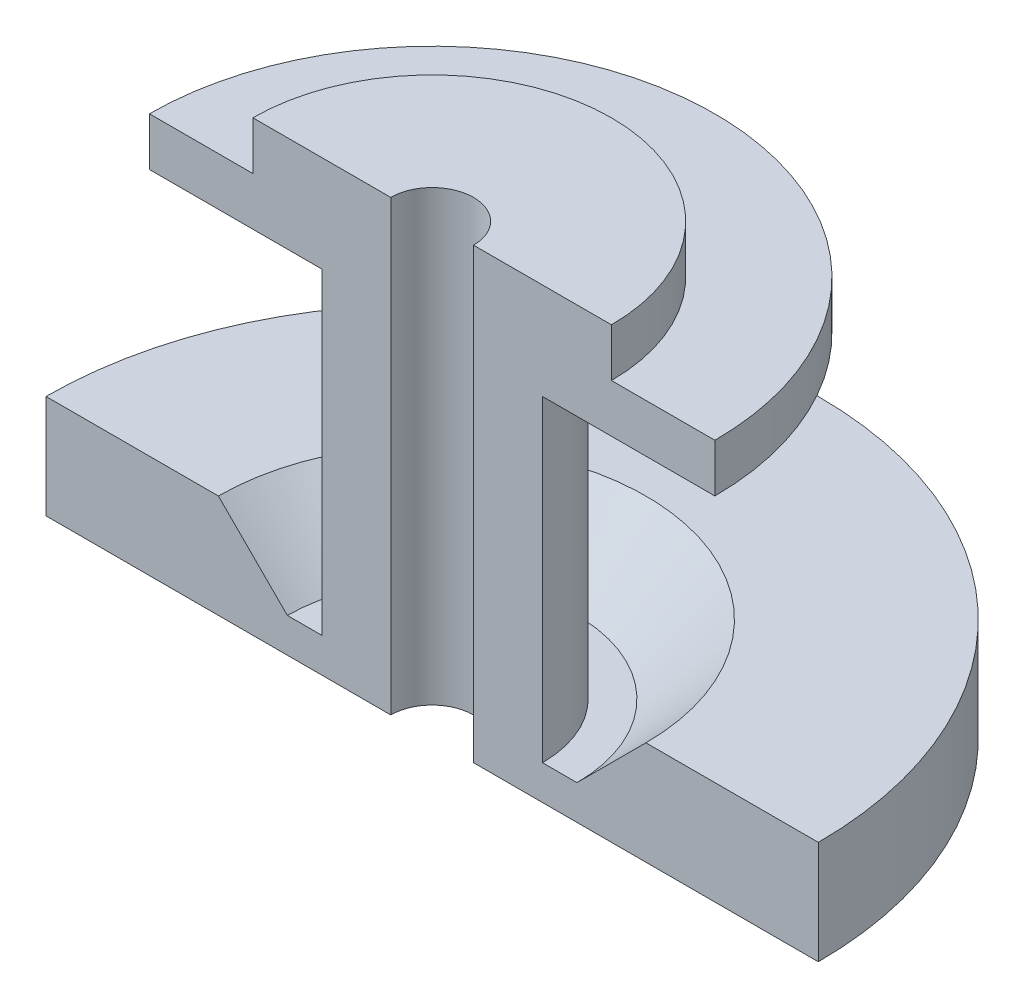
ISO-10303-21;
HEADER;
FILE_DESCRIPTION(('STEP AP214'),'2;1');
FILE_NAME('part.step','',(''),(''),'','','');
FILE_SCHEMA(('AUTOMOTIVE_DESIGN { 1 0 10303 214 1 1 1 1 }'));
ENDSEC;
DATA;
#1=APPLICATION_CONTEXT('core data for automotive mechanical design processes');
#2=APPLICATION_PROTOCOL_DEFINITION('international standard','automotive_design',2000,#1);
#3=PRODUCT_CONTEXT('',#1,'mechanical');
#4=PRODUCT('Part','Part','',(#3));
#5=PRODUCT_RELATED_PRODUCT_CATEGORY('part','',(#4));
#6=PRODUCT_DEFINITION_FORMATION('','',#4);
#7=PRODUCT_DEFINITION_CONTEXT('part definition',#1,'design');
#8=PRODUCT_DEFINITION('design','',#6,#7);
#9=PRODUCT_DEFINITION_SHAPE('','',#8);
#10=(LENGTH_UNIT() NAMED_UNIT(*) SI_UNIT(.MILLI.,.METRE.));
#11=(NAMED_UNIT(*) PLANE_ANGLE_UNIT() SI_UNIT($,.RADIAN.));
#12=(NAMED_UNIT(*) SI_UNIT($,.STERADIAN.) SOLID_ANGLE_UNIT());
#13=UNCERTAINTY_MEASURE_WITH_UNIT(LENGTH_MEASURE(1.E-05),#10,'distance_accuracy_value','');
#14=(GEOMETRIC_REPRESENTATION_CONTEXT(3) GLOBAL_UNCERTAINTY_ASSIGNED_CONTEXT((#13)) GLOBAL_UNIT_ASSIGNED_CONTEXT((#10,
#11,#12)) REPRESENTATION_CONTEXT('',''));
#15=CARTESIAN_POINT('',(0.,0.,0.));
#16=DIRECTION('',(0.,0.,1.));
#17=DIRECTION('',(1.,0.,0.));
#18=AXIS2_PLACEMENT_3D('',#15,#16,#17);
#19=CARTESIAN_POINT('',(0.,0.,0.));
#20=DIRECTION('',(0.,-1.,0.));
#21=DIRECTION('',(0.,0.,-1.));
#22=AXIS2_PLACEMENT_3D('',#19,#20,#21);
#23=CYLINDRICAL_SURFACE('',#22,26.);
#24=CARTESIAN_POINT('',(0.,0.,0.));
#25=DIRECTION('',(0.,-1.,0.));
#26=DIRECTION('',(0.,0.,-1.));
#27=AXIS2_PLACEMENT_3D('',#24,#25,#26);
#28=CIRCLE('',#27,26.);
#29=CARTESIAN_POINT('',(-26.,0.,1.81557134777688E-13));
#30=VERTEX_POINT('',#29);
#31=CARTESIAN_POINT('',(26.,0.,0.));
#32=VERTEX_POINT('',#31);
#33=EDGE_CURVE('E11',#30,#32,#28,.T.);
#34=ORIENTED_EDGE('',*,*,#33,.T.);
#35=DIRECTION('',(0.,1.,0.));
#36=VECTOR('',#35,1.);
#37=CARTESIAN_POINT('',(26.,0.,0.));
#38=LINE('',#37,#36);
#39=CARTESIAN_POINT('',(26.,-7.,0.));
#40=VERTEX_POINT('',#39);
#41=EDGE_CURVE('E121',#40,#32,#38,.T.);
#42=ORIENTED_EDGE('',*,*,#41,.F.);
#43=CARTESIAN_POINT('',(0.,-7.,0.));
#44=DIRECTION('',(0.,-1.,0.));
#45=DIRECTION('',(0.,0.,-1.));
#46=AXIS2_PLACEMENT_3D('',#43,#44,#45);
#47=CIRCLE('',#46,26.);
#48=CARTESIAN_POINT('',(-26.,-7.,1.81557134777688E-13));
#49=VERTEX_POINT('',#48);
#50=EDGE_CURVE('E48',#49,#40,#47,.T.);
#51=ORIENTED_EDGE('',*,*,#50,.F.);
#52=DIRECTION('',(0.,1.,0.));
#53=VECTOR('',#52,1.);
#54=CARTESIAN_POINT('',(-26.,0.,1.81557134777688E-13));
#55=LINE('',#54,#53);
#56=EDGE_CURVE('E123',#49,#30,#55,.T.);
#57=ORIENTED_EDGE('',*,*,#56,.T.);
#58=EDGE_LOOP('',(#34,#42,#51,#57));
#59=FACE_BOUND('',#58,.T.);
#60=ADVANCED_FACE('F33',(#59),#23,.T.);
#61=CARTESIAN_POINT('',(-26.,0.,1.81557134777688E-13));
#62=DIRECTION('',(0.,1.,0.));
#63=DIRECTION('',(0.,0.,1.));
#64=AXIS2_PLACEMENT_3D('',#61,#62,#63);
#65=PLANE('',#64);
#66=CARTESIAN_POINT('',(0.,0.,0.));
#67=DIRECTION('',(0.,-1.,0.));
#68=DIRECTION('',(0.,0.,-1.));
#69=AXIS2_PLACEMENT_3D('',#66,#67,#68);
#70=CIRCLE('',#69,6.);
#71=CARTESIAN_POINT('',(-6.,0.,0.));
#72=VERTEX_POINT('',#71);
#73=CARTESIAN_POINT('',(6.,0.,0.));
#74=VERTEX_POINT('',#73);
#75=EDGE_CURVE('E41',#72,#74,#70,.T.);
#76=ORIENTED_EDGE('',*,*,#75,.T.);
#77=DIRECTION('',(-1.,0.,0.));
#78=VECTOR('',#77,1.);
#79=CARTESIAN_POINT('',(26.,0.,0.));
#80=LINE('',#79,#78);
#81=EDGE_CURVE('E132',#32,#74,#80,.T.);
#82=ORIENTED_EDGE('',*,*,#81,.F.);
#83=ORIENTED_EDGE('',*,*,#33,.F.);
#84=DIRECTION('',(1.,0.,0.));
#85=VECTOR('',#84,1.);
#86=CARTESIAN_POINT('',(-26.,0.,1.81557134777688E-13));
#87=LINE('',#86,#85);
#88=EDGE_CURVE('E166',#30,#72,#87,.T.);
#89=ORIENTED_EDGE('',*,*,#88,.T.);
#90=EDGE_LOOP('',(#76,#82,#83,#89));
#91=FACE_BOUND('',#90,.T.);
#92=ADVANCED_FACE('F35',(#91),#65,.T.);
#93=CARTESIAN_POINT('',(0.,0.,0.));
#94=DIRECTION('',(0.,-1.,0.));
#95=DIRECTION('',(0.,0.,-1.));
#96=AXIS2_PLACEMENT_3D('',#93,#94,#95);
#97=CYLINDRICAL_SURFACE('',#96,6.);
#98=CARTESIAN_POINT('',(0.,-65.,0.));
#99=DIRECTION('',(0.,-1.,0.));
#100=DIRECTION('',(0.,0.,-1.));
#101=AXIS2_PLACEMENT_3D('',#98,#99,#100);
#102=CIRCLE('',#101,6.);
#103=CARTESIAN_POINT('',(-6.,-65.,0.));
#104=VERTEX_POINT('',#103);
#105=CARTESIAN_POINT('',(6.,-65.,0.));
#106=VERTEX_POINT('',#105);
#107=EDGE_CURVE('E212',#104,#106,#102,.T.);
#108=ORIENTED_EDGE('',*,*,#107,.T.);
#109=DIRECTION('',(0.,-1.,0.));
#110=VECTOR('',#109,1.);
#111=CARTESIAN_POINT('',(6.,0.,0.));
#112=LINE('',#111,#110);
#113=EDGE_CURVE('E137',#74,#106,#112,.T.);
#114=ORIENTED_EDGE('',*,*,#113,.F.);
#115=ORIENTED_EDGE('',*,*,#75,.F.);
#116=DIRECTION('',(0.,-1.,0.));
#117=VECTOR('',#116,1.);
#118=CARTESIAN_POINT('',(-6.,0.,0.));
#119=LINE('',#118,#117);
#120=EDGE_CURVE('E168',#72,#104,#119,.T.);
#121=ORIENTED_EDGE('',*,*,#120,.T.);
#122=EDGE_LOOP('',(#108,#114,#115,#121));
#123=FACE_BOUND('',#122,.T.);
#124=ADVANCED_FACE('F214',(#123),#97,.F.);
#125=CARTESIAN_POINT('',(-56.,-65.,3.91046136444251E-13));
#126=DIRECTION('',(0.,-1.,0.));
#127=DIRECTION('',(0.,0.,-1.));
#128=AXIS2_PLACEMENT_3D('',#125,#126,#127);
#129=PLANE('',#128);
#130=CARTESIAN_POINT('',(0.,-65.,0.));
#131=DIRECTION('',(0.,-1.,0.));
#132=DIRECTION('',(0.,0.,-1.));
#133=AXIS2_PLACEMENT_3D('',#130,#131,#132);
#134=CIRCLE('',#133,56.);
#135=CARTESIAN_POINT('',(-56.,-65.,3.91046136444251E-13));
#136=VERTEX_POINT('',#135);
#137=CARTESIAN_POINT('',(56.,-65.,0.));
#138=VERTEX_POINT('',#137);
#139=EDGE_CURVE('E210',#136,#138,#134,.T.);
#140=ORIENTED_EDGE('',*,*,#139,.T.);
#141=DIRECTION('',(1.,0.,0.));
#142=VECTOR('',#141,1.);
#143=CARTESIAN_POINT('',(56.,-65.,0.));
#144=LINE('',#143,#142);
#145=EDGE_CURVE('E139',#106,#138,#144,.T.);
#146=ORIENTED_EDGE('',*,*,#145,.F.);
#147=ORIENTED_EDGE('',*,*,#107,.F.);
#148=DIRECTION('',(-1.,0.,0.));
#149=VECTOR('',#148,1.);
#150=CARTESIAN_POINT('',(-56.,-65.,3.91046136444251E-13));
#151=LINE('',#150,#149);
#152=EDGE_CURVE('E171',#104,#136,#151,.T.);
#153=ORIENTED_EDGE('',*,*,#152,.T.);
#154=EDGE_LOOP('',(#140,#146,#147,#153));
#155=FACE_BOUND('',#154,.T.);
#156=ADVANCED_FACE('F220',(#155),#129,.T.);
#157=CARTESIAN_POINT('',(0.,0.,0.));
#158=DIRECTION('',(0.,-1.,0.));
#159=DIRECTION('',(0.,0.,-1.));
#160=AXIS2_PLACEMENT_3D('',#157,#158,#159);
#161=CYLINDRICAL_SURFACE('',#160,56.);
#162=CARTESIAN_POINT('',(0.,-50.,0.));
#163=DIRECTION('',(0.,-1.,0.));
#164=DIRECTION('',(0.,0.,-1.));
#165=AXIS2_PLACEMENT_3D('',#162,#163,#164);
#166=CIRCLE('',#165,56.);
#167=CARTESIAN_POINT('',(-56.,-50.,3.91046136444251E-13));
#168=VERTEX_POINT('',#167);
#169=CARTESIAN_POINT('',(56.,-50.,0.));
#170=VERTEX_POINT('',#169);
#171=EDGE_CURVE('E208',#168,#170,#166,.T.);
#172=ORIENTED_EDGE('',*,*,#171,.T.);
#173=DIRECTION('',(0.,1.,0.));
#174=VECTOR('',#173,1.);
#175=CARTESIAN_POINT('',(56.,-50.,0.));
#176=LINE('',#175,#174);
#177=EDGE_CURVE('E144',#138,#170,#176,.T.);
#178=ORIENTED_EDGE('',*,*,#177,.F.);
#179=ORIENTED_EDGE('',*,*,#139,.F.);
#180=DIRECTION('',(0.,1.,0.));
#181=VECTOR('',#180,1.);
#182=CARTESIAN_POINT('',(-56.,-50.,3.91046136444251E-13));
#183=LINE('',#182,#181);
#184=EDGE_CURVE('E174',#136,#168,#183,.T.);
#185=ORIENTED_EDGE('',*,*,#184,.T.);
#186=EDGE_LOOP('',(#172,#178,#179,#185));
#187=FACE_BOUND('',#186,.T.);
#188=ADVANCED_FACE('F223',(#187),#161,.T.);
#189=CARTESIAN_POINT('',(-31.,-50.,2.16471968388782E-13));
#190=DIRECTION('',(0.,1.,0.));
#191=DIRECTION('',(0.,0.,1.));
#192=AXIS2_PLACEMENT_3D('',#189,#190,#191);
#193=PLANE('',#192);
#194=CARTESIAN_POINT('',(0.,-50.,0.));
#195=DIRECTION('',(0.,-1.,0.));
#196=DIRECTION('',(0.,0.,-1.));
#197=AXIS2_PLACEMENT_3D('',#194,#195,#196);
#198=CIRCLE('',#197,31.);
#199=CARTESIAN_POINT('',(-31.,-50.,2.16471968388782E-13));
#200=VERTEX_POINT('',#199);
#201=CARTESIAN_POINT('',(31.,-50.,0.));
#202=VERTEX_POINT('',#201);
#203=EDGE_CURVE('E206',#200,#202,#198,.T.);
#204=ORIENTED_EDGE('',*,*,#203,.T.);
#205=DIRECTION('',(-1.,0.,0.));
#206=VECTOR('',#205,1.);
#207=CARTESIAN_POINT('',(31.,-50.,0.));
#208=LINE('',#207,#206);
#209=EDGE_CURVE('E147',#170,#202,#208,.T.);
#210=ORIENTED_EDGE('',*,*,#209,.F.);
#211=ORIENTED_EDGE('',*,*,#171,.F.);
#212=DIRECTION('',(1.,0.,0.));
#213=VECTOR('',#212,1.);
#214=CARTESIAN_POINT('',(-31.,-50.,2.16471968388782E-13));
#215=LINE('',#214,#213);
#216=EDGE_CURVE('E177',#168,#200,#215,.T.);
#217=ORIENTED_EDGE('',*,*,#216,.T.);
#218=EDGE_LOOP('',(#204,#210,#211,#217));
#219=FACE_BOUND('',#218,.T.);
#220=ADVANCED_FACE('F228',(#219),#193,.T.);
#221=CARTESIAN_POINT('',(0.,-50.,0.));
#222=DIRECTION('',(0.,1.,0.));
#223=DIRECTION('',(0.,0.,1.));
#224=AXIS2_PLACEMENT_3D('',#221,#222,#223);
#225=CONICAL_SURFACE('',#224,31.,0.785398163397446);
#226=CARTESIAN_POINT('',(0.,-60.,0.));
#227=DIRECTION('',(0.,-1.,0.));
#228=DIRECTION('',(0.,0.,-1.));
#229=AXIS2_PLACEMENT_3D('',#226,#227,#228);
#230=CIRCLE('',#229,21.0000000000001);
#231=CARTESIAN_POINT('',(-21.0000000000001,-60.,1.46642301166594E-13));
#232=VERTEX_POINT('',#231);
#233=CARTESIAN_POINT('',(21.0000000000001,-60.,0.));
#234=VERTEX_POINT('',#233);
#235=EDGE_CURVE('E204',#232,#234,#230,.T.);
#236=ORIENTED_EDGE('',*,*,#235,.T.);
#237=DIRECTION('',(-0.707106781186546,-0.707106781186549,0.));
#238=VECTOR('',#237,1.);
#239=CARTESIAN_POINT('',(21.0000000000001,-60.,0.));
#240=LINE('',#239,#238);
#241=EDGE_CURVE('E150',#202,#234,#240,.T.);
#242=ORIENTED_EDGE('',*,*,#241,.F.);
#243=ORIENTED_EDGE('',*,*,#203,.F.);
#244=DIRECTION('',(0.707106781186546,-0.707106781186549,0.));
#245=VECTOR('',#244,1.);
#246=CARTESIAN_POINT('',(-21.0000000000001,-60.,1.46642301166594E-13));
#247=LINE('',#246,#245);
#248=EDGE_CURVE('E180',#200,#232,#247,.T.);
#249=ORIENTED_EDGE('',*,*,#248,.T.);
#250=EDGE_LOOP('',(#236,#242,#243,#249));
#251=FACE_BOUND('',#250,.T.);
#252=ADVANCED_FACE('F231',(#251),#225,.F.);
#253=CARTESIAN_POINT('',(-16.,-60.,1.117274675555E-13));
#254=DIRECTION('',(0.,1.,0.));
#255=DIRECTION('',(0.,0.,1.));
#256=AXIS2_PLACEMENT_3D('',#253,#254,#255);
#257=PLANE('',#256);
#258=CARTESIAN_POINT('',(0.,-60.,0.));
#259=DIRECTION('',(0.,-1.,0.));
#260=DIRECTION('',(0.,0.,-1.));
#261=AXIS2_PLACEMENT_3D('',#258,#259,#260);
#262=CIRCLE('',#261,16.);
#263=CARTESIAN_POINT('',(-16.,-60.,1.117274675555E-13));
#264=VERTEX_POINT('',#263);
#265=CARTESIAN_POINT('',(16.,-60.,0.));
#266=VERTEX_POINT('',#265);
#267=EDGE_CURVE('E202',#264,#266,#262,.T.);
#268=ORIENTED_EDGE('',*,*,#267,.T.);
#269=DIRECTION('',(-1.,0.,0.));
#270=VECTOR('',#269,1.);
#271=CARTESIAN_POINT('',(16.,-60.,0.));
#272=LINE('',#271,#270);
#273=EDGE_CURVE('E153',#234,#266,#272,.T.);
#274=ORIENTED_EDGE('',*,*,#273,.F.);
#275=ORIENTED_EDGE('',*,*,#235,.F.);
#276=DIRECTION('',(1.,0.,0.));
#277=VECTOR('',#276,1.);
#278=CARTESIAN_POINT('',(-16.,-60.,1.117274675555E-13));
#279=LINE('',#278,#277);
#280=EDGE_CURVE('E183',#232,#264,#279,.T.);
#281=ORIENTED_EDGE('',*,*,#280,.T.);
#282=EDGE_LOOP('',(#268,#274,#275,#281));
#283=FACE_BOUND('',#282,.T.);
#284=ADVANCED_FACE('F236',(#283),#257,.T.);
#285=CARTESIAN_POINT('',(0.,0.,0.));
#286=DIRECTION('',(0.,-1.,0.));
#287=DIRECTION('',(0.,0.,-1.));
#288=AXIS2_PLACEMENT_3D('',#285,#286,#287);
#289=CYLINDRICAL_SURFACE('',#288,16.);
#290=CARTESIAN_POINT('',(0.,-14.,0.));
#291=DIRECTION('',(0.,-1.,0.));
#292=DIRECTION('',(0.,0.,-1.));
#293=AXIS2_PLACEMENT_3D('',#290,#291,#292);
#294=CIRCLE('',#293,16.);
#295=CARTESIAN_POINT('',(-16.,-14.,1.117274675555E-13));
#296=VERTEX_POINT('',#295);
#297=CARTESIAN_POINT('',(16.,-14.,0.));
#298=VERTEX_POINT('',#297);
#299=EDGE_CURVE('E200',#296,#298,#294,.T.);
#300=ORIENTED_EDGE('',*,*,#299,.T.);
#301=DIRECTION('',(0.,1.,0.));
#302=VECTOR('',#301,1.);
#303=CARTESIAN_POINT('',(16.,-14.,0.));
#304=LINE('',#303,#302);
#305=EDGE_CURVE('E156',#266,#298,#304,.T.);
#306=ORIENTED_EDGE('',*,*,#305,.F.);
#307=ORIENTED_EDGE('',*,*,#267,.F.);
#308=DIRECTION('',(0.,1.,0.));
#309=VECTOR('',#308,1.);
#310=CARTESIAN_POINT('',(-16.,-14.,1.117274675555E-13));
#311=LINE('',#310,#309);
#312=EDGE_CURVE('E186',#264,#296,#311,.T.);
#313=ORIENTED_EDGE('',*,*,#312,.T.);
#314=EDGE_LOOP('',(#300,#306,#307,#313));
#315=FACE_BOUND('',#314,.T.);
#316=ADVANCED_FACE('F239',(#315),#289,.T.);
#317=CARTESIAN_POINT('',(-41.,-14.,2.86301635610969E-13));
#318=DIRECTION('',(0.,-1.,0.));
#319=DIRECTION('',(0.,0.,-1.));
#320=AXIS2_PLACEMENT_3D('',#317,#318,#319);
#321=PLANE('',#320);
#322=CARTESIAN_POINT('',(0.,-14.,0.));
#323=DIRECTION('',(0.,-1.,0.));
#324=DIRECTION('',(0.,0.,-1.));
#325=AXIS2_PLACEMENT_3D('',#322,#323,#324);
#326=CIRCLE('',#325,41.);
#327=CARTESIAN_POINT('',(-41.,-14.,2.86301635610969E-13));
#328=VERTEX_POINT('',#327);
#329=CARTESIAN_POINT('',(41.,-14.,0.));
#330=VERTEX_POINT('',#329);
#331=EDGE_CURVE('E198',#328,#330,#326,.T.);
#332=ORIENTED_EDGE('',*,*,#331,.T.);
#333=DIRECTION('',(1.,0.,0.));
#334=VECTOR('',#333,1.);
#335=CARTESIAN_POINT('',(41.,-14.,0.));
#336=LINE('',#335,#334);
#337=EDGE_CURVE('E159',#298,#330,#336,.T.);
#338=ORIENTED_EDGE('',*,*,#337,.F.);
#339=ORIENTED_EDGE('',*,*,#299,.F.);
#340=DIRECTION('',(-1.,0.,0.));
#341=VECTOR('',#340,1.);
#342=CARTESIAN_POINT('',(-41.,-14.,2.86301635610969E-13));
#343=LINE('',#342,#341);
#344=EDGE_CURVE('E189',#296,#328,#343,.T.);
#345=ORIENTED_EDGE('',*,*,#344,.T.);
#346=EDGE_LOOP('',(#332,#338,#339,#345));
#347=FACE_BOUND('',#346,.T.);
#348=ADVANCED_FACE('F244',(#347),#321,.T.);
#349=CARTESIAN_POINT('',(0.,0.,0.));
#350=DIRECTION('',(0.,-1.,0.));
#351=DIRECTION('',(0.,0.,-1.));
#352=AXIS2_PLACEMENT_3D('',#349,#350,#351);
#353=CYLINDRICAL_SURFACE('',#352,41.);
#354=CARTESIAN_POINT('',(0.,-7.,0.));
#355=DIRECTION('',(0.,-1.,0.));
#356=DIRECTION('',(0.,0.,-1.));
#357=AXIS2_PLACEMENT_3D('',#354,#355,#356);
#358=CIRCLE('',#357,41.);
#359=CARTESIAN_POINT('',(-41.,-7.,2.86301635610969E-13));
#360=VERTEX_POINT('',#359);
#361=CARTESIAN_POINT('',(41.,-7.,0.));
#362=VERTEX_POINT('',#361);
#363=EDGE_CURVE('E56',#360,#362,#358,.T.);
#364=ORIENTED_EDGE('',*,*,#363,.T.);
#365=DIRECTION('',(0.,1.,0.));
#366=VECTOR('',#365,1.);
#367=CARTESIAN_POINT('',(41.,-7.,0.));
#368=LINE('',#367,#366);
#369=EDGE_CURVE('E162',#330,#362,#368,.T.);
#370=ORIENTED_EDGE('',*,*,#369,.F.);
#371=ORIENTED_EDGE('',*,*,#331,.F.);
#372=DIRECTION('',(0.,1.,0.));
#373=VECTOR('',#372,1.);
#374=CARTESIAN_POINT('',(-41.,-7.,2.86301635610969E-13));
#375=LINE('',#374,#373);
#376=EDGE_CURVE('E192',#328,#360,#375,.T.);
#377=ORIENTED_EDGE('',*,*,#376,.T.);
#378=EDGE_LOOP('',(#364,#370,#371,#377));
#379=FACE_BOUND('',#378,.T.);
#380=ADVANCED_FACE('F247',(#379),#353,.T.);
#381=CARTESIAN_POINT('',(-26.,-7.,1.81557134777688E-13));
#382=DIRECTION('',(0.,1.,0.));
#383=DIRECTION('',(0.,0.,1.));
#384=AXIS2_PLACEMENT_3D('',#381,#382,#383);
#385=PLANE('',#384);
#386=DIRECTION('',(1.,0.,0.));
#387=VECTOR('',#386,1.);
#388=CARTESIAN_POINT('',(-26.,-7.,1.81557134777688E-13));
#389=LINE('',#388,#387);
#390=EDGE_CURVE('E194',#360,#49,#389,.T.);
#391=ORIENTED_EDGE('',*,*,#390,.T.);
#392=ORIENTED_EDGE('',*,*,#50,.T.);
#393=DIRECTION('',(-1.,0.,0.));
#394=VECTOR('',#393,1.);
#395=CARTESIAN_POINT('',(26.,-7.,0.));
#396=LINE('',#395,#394);
#397=EDGE_CURVE('E135',#362,#40,#396,.T.);
#398=ORIENTED_EDGE('',*,*,#397,.F.);
#399=ORIENTED_EDGE('',*,*,#363,.F.);
#400=EDGE_LOOP('',(#391,#392,#398,#399));
#401=FACE_BOUND('',#400,.T.);
#402=ADVANCED_FACE('F249',(#401),#385,.T.);
#403=CARTESIAN_POINT('',(-26.,-7.,1.81557134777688E-13));
#404=DIRECTION('',(0.,0.,-1.));
#405=DIRECTION('',(-1.,0.,0.));
#406=AXIS2_PLACEMENT_3D('',#403,#404,#405);
#407=PLANE('',#406);
#408=ORIENTED_EDGE('',*,*,#56,.F.);
#409=ORIENTED_EDGE('',*,*,#390,.F.);
#410=ORIENTED_EDGE('',*,*,#376,.F.);
#411=ORIENTED_EDGE('',*,*,#344,.F.);
#412=ORIENTED_EDGE('',*,*,#312,.F.);
#413=ORIENTED_EDGE('',*,*,#280,.F.);
#414=ORIENTED_EDGE('',*,*,#248,.F.);
#415=ORIENTED_EDGE('',*,*,#216,.F.);
#416=ORIENTED_EDGE('',*,*,#184,.F.);
#417=ORIENTED_EDGE('',*,*,#152,.F.);
#418=ORIENTED_EDGE('',*,*,#120,.F.);
#419=ORIENTED_EDGE('',*,*,#88,.F.);
#420=EDGE_LOOP('',(#408,#409,#410,#411,#412,#413,#414,#415,#416,#417,#418,#419));
#421=FACE_BOUND('',#420,.T.);
#422=ADVANCED_FACE('F251',(#421),#407,.F.);
#423=CARTESIAN_POINT('',(26.,-7.,0.));
#424=DIRECTION('',(0.,0.,1.));
#425=DIRECTION('',(1.,0.,0.));
#426=AXIS2_PLACEMENT_3D('',#423,#424,#425);
#427=PLANE('',#426);
#428=ORIENTED_EDGE('',*,*,#41,.T.);
#429=ORIENTED_EDGE('',*,*,#81,.T.);
#430=ORIENTED_EDGE('',*,*,#113,.T.);
#431=ORIENTED_EDGE('',*,*,#145,.T.);
#432=ORIENTED_EDGE('',*,*,#177,.T.);
#433=ORIENTED_EDGE('',*,*,#209,.T.);
#434=ORIENTED_EDGE('',*,*,#241,.T.);
#435=ORIENTED_EDGE('',*,*,#273,.T.);
#436=ORIENTED_EDGE('',*,*,#305,.T.);
#437=ORIENTED_EDGE('',*,*,#337,.T.);
#438=ORIENTED_EDGE('',*,*,#369,.T.);
#439=ORIENTED_EDGE('',*,*,#397,.T.);
#440=EDGE_LOOP('',(#428,#429,#430,#431,#432,#433,#434,#435,#436,#437,#438,#439));
#441=FACE_BOUND('',#440,.T.);
#442=ADVANCED_FACE('F130',(#441),#427,.T.);
#443=CLOSED_SHELL('',(#60,#92,#124,#156,#188,#220,#252,#284,#316,#348,#380,#402,#422,#442));
#444=MANIFOLD_SOLID_BREP('B2',#443);
#445=ADVANCED_BREP_SHAPE_REPRESENTATION('',(#18,#444),#14);
#446=SHAPE_DEFINITION_REPRESENTATION(#9,#445);
ENDSEC;
END-ISO-10303-21;
